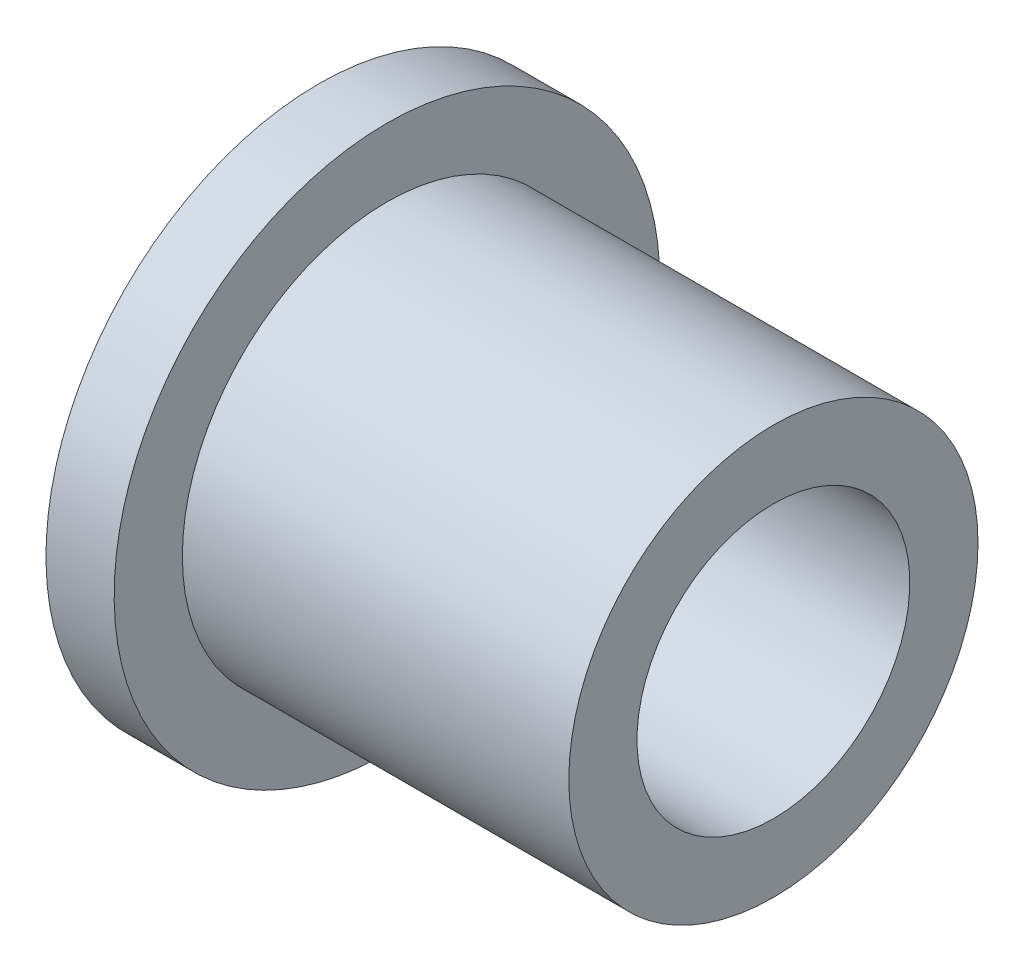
ISO-10303-21;
HEADER;
FILE_DESCRIPTION(('STEP AP214'),'2;1');
FILE_NAME('part.step','',(''),(''),'','','');
FILE_SCHEMA(('AUTOMOTIVE_DESIGN { 1 0 10303 214 1 1 1 1 }'));
ENDSEC;
DATA;
#1=APPLICATION_CONTEXT('core data for automotive mechanical design processes');
#2=APPLICATION_PROTOCOL_DEFINITION('international standard','automotive_design',2000,#1);
#3=PRODUCT_CONTEXT('',#1,'mechanical');
#4=PRODUCT('Part','Part','',(#3));
#5=PRODUCT_RELATED_PRODUCT_CATEGORY('part','',(#4));
#6=PRODUCT_DEFINITION_FORMATION('','',#4);
#7=PRODUCT_DEFINITION_CONTEXT('part definition',#1,'design');
#8=PRODUCT_DEFINITION('design','',#6,#7);
#9=PRODUCT_DEFINITION_SHAPE('','',#8);
#10=(LENGTH_UNIT() NAMED_UNIT(*) SI_UNIT(.MILLI.,.METRE.));
#11=(NAMED_UNIT(*) PLANE_ANGLE_UNIT() SI_UNIT($,.RADIAN.));
#12=(NAMED_UNIT(*) SI_UNIT($,.STERADIAN.) SOLID_ANGLE_UNIT());
#13=UNCERTAINTY_MEASURE_WITH_UNIT(LENGTH_MEASURE(1.E-05),#10,'distance_accuracy_value','');
#14=(GEOMETRIC_REPRESENTATION_CONTEXT(3) GLOBAL_UNCERTAINTY_ASSIGNED_CONTEXT((#13)) GLOBAL_UNIT_ASSIGNED_CONTEXT((#10,
#11,#12)) REPRESENTATION_CONTEXT('',''));
#15=CARTESIAN_POINT('',(0.,0.,0.));
#16=DIRECTION('',(0.,0.,1.));
#17=DIRECTION('',(1.,0.,0.));
#18=AXIS2_PLACEMENT_3D('',#15,#16,#17);
#19=CARTESIAN_POINT('',(0.,0.,0.));
#20=DIRECTION('',(1.,0.,0.));
#21=DIRECTION('',(0.,1.,0.));
#22=AXIS2_PLACEMENT_3D('',#19,#20,#21);
#23=CYLINDRICAL_SURFACE('',#22,12.);
#24=CARTESIAN_POINT('',(-20.,0.,0.));
#25=DIRECTION('',(1.,0.,0.));
#26=DIRECTION('',(0.,1.,0.));
#27=AXIS2_PLACEMENT_3D('',#24,#25,#26);
#28=CIRCLE('',#27,12.);
#29=CARTESIAN_POINT('',(-20.,12.,0.));
#30=VERTEX_POINT('',#29);
#31=EDGE_CURVE('E55',#30,#30,#28,.T.);
#32=ORIENTED_EDGE('',*,*,#31,.T.);
#33=EDGE_LOOP('',(#32));
#34=FACE_BOUND('',#33,.T.);
#35=CARTESIAN_POINT('',(-17.,0.,0.));
#36=DIRECTION('',(1.,0.,0.));
#37=DIRECTION('',(0.,1.,0.));
#38=AXIS2_PLACEMENT_3D('',#35,#36,#37);
#39=CIRCLE('',#38,12.);
#40=CARTESIAN_POINT('',(-17.,12.,0.));
#41=VERTEX_POINT('',#40);
#42=EDGE_CURVE('E10',#41,#41,#39,.T.);
#43=ORIENTED_EDGE('',*,*,#42,.F.);
#44=EDGE_LOOP('',(#43));
#45=FACE_BOUND('',#44,.T.);
#46=ADVANCED_FACE('F33',(#34,#45),#23,.T.);
#47=CARTESIAN_POINT('',(-17.,12.,0.));
#48=DIRECTION('',(1.,0.,0.));
#49=DIRECTION('',(0.,1.,0.));
#50=AXIS2_PLACEMENT_3D('',#47,#48,#49);
#51=PLANE('',#50);
#52=ORIENTED_EDGE('',*,*,#42,.T.);
#53=EDGE_LOOP('',(#52));
#54=FACE_BOUND('',#53,.T.);
#55=CARTESIAN_POINT('',(-17.,0.,0.));
#56=DIRECTION('',(1.,0.,0.));
#57=DIRECTION('',(0.,1.,0.));
#58=AXIS2_PLACEMENT_3D('',#55,#56,#57);
#59=CIRCLE('',#58,9.);
#60=CARTESIAN_POINT('',(-17.,9.,0.));
#61=VERTEX_POINT('',#60);
#62=EDGE_CURVE('E39',#61,#61,#59,.T.);
#63=ORIENTED_EDGE('',*,*,#62,.F.);
#64=EDGE_LOOP('',(#63));
#65=FACE_BOUND('',#64,.T.);
#66=ADVANCED_FACE('F73',(#54,#65),#51,.T.);
#67=CARTESIAN_POINT('',(0.,0.,0.));
#68=DIRECTION('',(1.,0.,0.));
#69=DIRECTION('',(0.,1.,0.));
#70=AXIS2_PLACEMENT_3D('',#67,#68,#69);
#71=CYLINDRICAL_SURFACE('',#70,9.);
#72=ORIENTED_EDGE('',*,*,#62,.T.);
#73=EDGE_LOOP('',(#72));
#74=FACE_BOUND('',#73,.T.);
#75=CARTESIAN_POINT('',(0.,0.,0.));
#76=DIRECTION('',(1.,0.,0.));
#77=DIRECTION('',(0.,1.,0.));
#78=AXIS2_PLACEMENT_3D('',#75,#76,#77);
#79=CIRCLE('',#78,9.);
#80=CARTESIAN_POINT('',(0.,9.,0.));
#81=VERTEX_POINT('',#80);
#82=EDGE_CURVE('E43',#81,#81,#79,.T.);
#83=ORIENTED_EDGE('',*,*,#82,.F.);
#84=EDGE_LOOP('',(#83));
#85=FACE_BOUND('',#84,.T.);
#86=ADVANCED_FACE('F77',(#74,#85),#71,.T.);
#87=CARTESIAN_POINT('',(0.,9.,0.));
#88=DIRECTION('',(1.,0.,0.));
#89=DIRECTION('',(0.,1.,0.));
#90=AXIS2_PLACEMENT_3D('',#87,#88,#89);
#91=PLANE('',#90);
#92=ORIENTED_EDGE('',*,*,#82,.T.);
#93=EDGE_LOOP('',(#92));
#94=FACE_BOUND('',#93,.T.);
#95=CARTESIAN_POINT('',(0.,0.,0.));
#96=DIRECTION('',(1.,0.,0.));
#97=DIRECTION('',(0.,1.,0.));
#98=AXIS2_PLACEMENT_3D('',#95,#96,#97);
#99=CIRCLE('',#98,6.);
#100=CARTESIAN_POINT('',(0.,6.,0.));
#101=VERTEX_POINT('',#100);
#102=EDGE_CURVE('E47',#101,#101,#99,.T.);
#103=ORIENTED_EDGE('',*,*,#102,.F.);
#104=EDGE_LOOP('',(#103));
#105=FACE_BOUND('',#104,.T.);
#106=ADVANCED_FACE('F69',(#94,#105),#91,.T.);
#107=CARTESIAN_POINT('',(0.,0.,0.));
#108=DIRECTION('',(1.,0.,0.));
#109=DIRECTION('',(0.,1.,0.));
#110=AXIS2_PLACEMENT_3D('',#107,#108,#109);
#111=CYLINDRICAL_SURFACE('',#110,6.);
#112=ORIENTED_EDGE('',*,*,#102,.T.);
#113=EDGE_LOOP('',(#112));
#114=FACE_BOUND('',#113,.T.);
#115=CARTESIAN_POINT('',(-20.,0.,0.));
#116=DIRECTION('',(1.,0.,0.));
#117=DIRECTION('',(0.,1.,0.));
#118=AXIS2_PLACEMENT_3D('',#115,#116,#117);
#119=CIRCLE('',#118,6.);
#120=CARTESIAN_POINT('',(-20.,6.,0.));
#121=VERTEX_POINT('',#120);
#122=EDGE_CURVE('E52',#121,#121,#119,.T.);
#123=ORIENTED_EDGE('',*,*,#122,.F.);
#124=EDGE_LOOP('',(#123));
#125=FACE_BOUND('',#124,.T.);
#126=ADVANCED_FACE('F63',(#114,#125),#111,.F.);
#127=CARTESIAN_POINT('',(-20.,6.,0.));
#128=DIRECTION('',(-1.,0.,0.));
#129=DIRECTION('',(0.,-1.,0.));
#130=AXIS2_PLACEMENT_3D('',#127,#128,#129);
#131=PLANE('',#130);
#132=ORIENTED_EDGE('',*,*,#122,.T.);
#133=EDGE_LOOP('',(#132));
#134=FACE_BOUND('',#133,.T.);
#135=ORIENTED_EDGE('',*,*,#31,.F.);
#136=EDGE_LOOP('',(#135));
#137=FACE_BOUND('',#136,.T.);
#138=ADVANCED_FACE('F61',(#134,#137),#131,.T.);
#139=CLOSED_SHELL('',(#46,#66,#86,#106,#126,#138));
#140=MANIFOLD_SOLID_BREP('B2',#139);
#141=ADVANCED_BREP_SHAPE_REPRESENTATION('',(#18,#140),#14);
#142=SHAPE_DEFINITION_REPRESENTATION(#9,#141);
ENDSEC;
END-ISO-10303-21;
